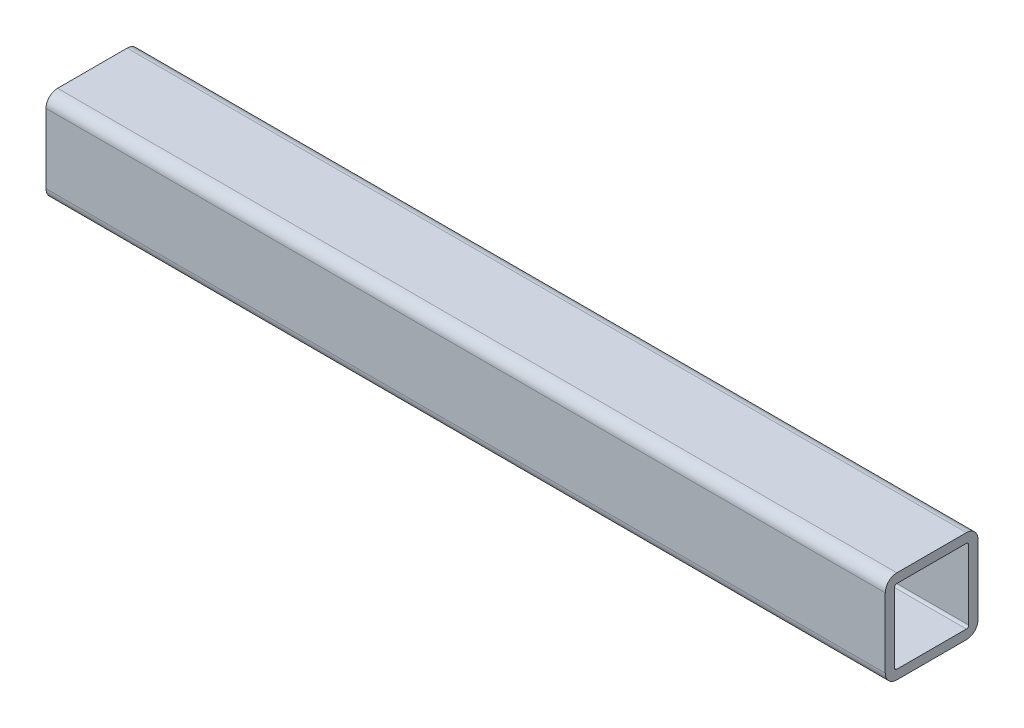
ISO-10303-21;
HEADER;
FILE_DESCRIPTION(('STEP AP214'),'2;1');
FILE_NAME('part.step','',(''),(''),'','','');
FILE_SCHEMA(('AUTOMOTIVE_DESIGN { 1 0 10303 214 1 1 1 1 }'));
ENDSEC;
DATA;
#1=APPLICATION_CONTEXT('core data for automotive mechanical design processes');
#2=APPLICATION_PROTOCOL_DEFINITION('international standard','automotive_design',2000,#1);
#3=PRODUCT_CONTEXT('',#1,'mechanical');
#4=PRODUCT('Part','Part','',(#3));
#5=PRODUCT_RELATED_PRODUCT_CATEGORY('part','',(#4));
#6=PRODUCT_DEFINITION_FORMATION('','',#4);
#7=PRODUCT_DEFINITION_CONTEXT('part definition',#1,'design');
#8=PRODUCT_DEFINITION('design','',#6,#7);
#9=PRODUCT_DEFINITION_SHAPE('','',#8);
#10=(LENGTH_UNIT() NAMED_UNIT(*) SI_UNIT(.MILLI.,.METRE.));
#11=(NAMED_UNIT(*) PLANE_ANGLE_UNIT() SI_UNIT($,.RADIAN.));
#12=(NAMED_UNIT(*) SI_UNIT($,.STERADIAN.) SOLID_ANGLE_UNIT());
#13=UNCERTAINTY_MEASURE_WITH_UNIT(LENGTH_MEASURE(1.E-05),#10,'distance_accuracy_value','');
#14=(GEOMETRIC_REPRESENTATION_CONTEXT(3) GLOBAL_UNCERTAINTY_ASSIGNED_CONTEXT((#13)) GLOBAL_UNIT_ASSIGNED_CONTEXT((#10,
#11,#12)) REPRESENTATION_CONTEXT('',''));
#15=CARTESIAN_POINT('',(0.,0.,0.));
#16=DIRECTION('',(0.,0.,1.));
#17=DIRECTION('',(1.,0.,0.));
#18=AXIS2_PLACEMENT_3D('',#15,#16,#17);
#19=CARTESIAN_POINT('',(180.969736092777,-7.5,7.5));
#20=DIRECTION('',(-1.,0.,0.));
#21=DIRECTION('',(0.,0.,1.));
#22=AXIS2_PLACEMENT_3D('',#19,#20,#21);
#23=CYLINDRICAL_SURFACE('',#22,2.5);
#24=CARTESIAN_POINT('',(0.,-7.5,7.5));
#25=DIRECTION('',(1.,0.,0.));
#26=DIRECTION('',(0.,0.,-1.));
#27=AXIS2_PLACEMENT_3D('',#24,#25,#26);
#28=CIRCLE('',#27,2.5);
#29=CARTESIAN_POINT('',(0.,-7.5,10.));
#30=VERTEX_POINT('',#29);
#31=CARTESIAN_POINT('',(0.,-10.,7.5));
#32=VERTEX_POINT('',#31);
#33=EDGE_CURVE('E208',#30,#32,#28,.T.);
#34=ORIENTED_EDGE('',*,*,#33,.T.);
#35=DIRECTION('',(-1.,0.,0.));
#36=VECTOR('',#35,1.);
#37=CARTESIAN_POINT('',(180.969736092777,-10.,7.5));
#38=LINE('',#37,#36);
#39=CARTESIAN_POINT('',(180.969736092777,-10.,7.5));
#40=VERTEX_POINT('',#39);
#41=EDGE_CURVE('E11',#40,#32,#38,.T.);
#42=ORIENTED_EDGE('',*,*,#41,.F.);
#43=CARTESIAN_POINT('',(180.969736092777,-7.5,7.5));
#44=DIRECTION('',(1.,0.,0.));
#45=DIRECTION('',(0.,0.,-1.));
#46=AXIS2_PLACEMENT_3D('',#43,#44,#45);
#47=CIRCLE('',#46,2.5);
#48=CARTESIAN_POINT('',(180.969736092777,-7.5,10.));
#49=VERTEX_POINT('',#48);
#50=EDGE_CURVE('E286',#49,#40,#47,.T.);
#51=ORIENTED_EDGE('',*,*,#50,.F.);
#52=DIRECTION('',(-1.,0.,0.));
#53=VECTOR('',#52,1.);
#54=CARTESIAN_POINT('',(180.969736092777,-7.5,10.));
#55=LINE('',#54,#53);
#56=EDGE_CURVE('E223',#49,#30,#55,.T.);
#57=ORIENTED_EDGE('',*,*,#56,.T.);
#58=EDGE_LOOP('',(#34,#42,#51,#57));
#59=FACE_BOUND('',#58,.T.);
#60=ADVANCED_FACE('F36',(#59),#23,.T.);
#61=CARTESIAN_POINT('',(180.969736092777,-10.,7.5));
#62=DIRECTION('',(0.,1.,0.));
#63=DIRECTION('',(0.,0.,1.));
#64=AXIS2_PLACEMENT_3D('',#61,#62,#63);
#65=PLANE('',#64);
#66=DIRECTION('',(0.,0.,-1.));
#67=VECTOR('',#66,1.);
#68=CARTESIAN_POINT('',(0.,-10.,7.5));
#69=LINE('',#68,#67);
#70=CARTESIAN_POINT('',(0.,-10.,-7.5));
#71=VERTEX_POINT('',#70);
#72=EDGE_CURVE('E211',#32,#71,#69,.T.);
#73=ORIENTED_EDGE('',*,*,#72,.T.);
#74=DIRECTION('',(-1.,0.,0.));
#75=VECTOR('',#74,1.);
#76=CARTESIAN_POINT('',(180.969736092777,-10.,-7.5));
#77=LINE('',#76,#75);
#78=CARTESIAN_POINT('',(180.969736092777,-10.,-7.5));
#79=VERTEX_POINT('',#78);
#80=EDGE_CURVE('E46',#79,#71,#77,.T.);
#81=ORIENTED_EDGE('',*,*,#80,.F.);
#82=DIRECTION('',(0.,0.,-1.));
#83=VECTOR('',#82,1.);
#84=CARTESIAN_POINT('',(180.969736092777,-10.,7.5));
#85=LINE('',#84,#83);
#86=EDGE_CURVE('E288',#40,#79,#85,.T.);
#87=ORIENTED_EDGE('',*,*,#86,.F.);
#88=ORIENTED_EDGE('',*,*,#41,.T.);
#89=EDGE_LOOP('',(#73,#81,#87,#88));
#90=FACE_BOUND('',#89,.T.);
#91=ADVANCED_FACE('F323',(#90),#65,.F.);
#92=CARTESIAN_POINT('',(180.969736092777,-7.5,-7.5));
#93=DIRECTION('',(-1.,0.,0.));
#94=DIRECTION('',(0.,0.,1.));
#95=AXIS2_PLACEMENT_3D('',#92,#93,#94);
#96=CYLINDRICAL_SURFACE('',#95,2.5);
#97=CARTESIAN_POINT('',(0.,-7.5,-7.5));
#98=DIRECTION('',(1.,0.,0.));
#99=DIRECTION('',(0.,0.,-1.));
#100=AXIS2_PLACEMENT_3D('',#97,#98,#99);
#101=CIRCLE('',#100,2.5);
#102=CARTESIAN_POINT('',(0.,-7.5,-10.));
#103=VERTEX_POINT('',#102);
#104=EDGE_CURVE('E213',#71,#103,#101,.T.);
#105=ORIENTED_EDGE('',*,*,#104,.T.);
#106=DIRECTION('',(-1.,0.,0.));
#107=VECTOR('',#106,1.);
#108=CARTESIAN_POINT('',(180.969736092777,-7.5,-10.));
#109=LINE('',#108,#107);
#110=CARTESIAN_POINT('',(180.969736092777,-7.5,-10.));
#111=VERTEX_POINT('',#110);
#112=EDGE_CURVE('E230',#111,#103,#109,.T.);
#113=ORIENTED_EDGE('',*,*,#112,.F.);
#114=CARTESIAN_POINT('',(180.969736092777,-7.5,-7.5));
#115=DIRECTION('',(1.,0.,0.));
#116=DIRECTION('',(0.,0.,-1.));
#117=AXIS2_PLACEMENT_3D('',#114,#115,#116);
#118=CIRCLE('',#117,2.5);
#119=EDGE_CURVE('E290',#79,#111,#118,.T.);
#120=ORIENTED_EDGE('',*,*,#119,.F.);
#121=ORIENTED_EDGE('',*,*,#80,.T.);
#122=EDGE_LOOP('',(#105,#113,#120,#121));
#123=FACE_BOUND('',#122,.T.);
#124=ADVANCED_FACE('F328',(#123),#96,.T.);
#125=CARTESIAN_POINT('',(180.969736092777,7.5,-10.));
#126=DIRECTION('',(0.,0.,1.));
#127=DIRECTION('',(1.,0.,0.));
#128=AXIS2_PLACEMENT_3D('',#125,#126,#127);
#129=PLANE('',#128);
#130=DIRECTION('',(0.,1.,0.));
#131=VECTOR('',#130,1.);
#132=CARTESIAN_POINT('',(0.,7.5,-10.));
#133=LINE('',#132,#131);
#134=CARTESIAN_POINT('',(0.,7.5,-10.));
#135=VERTEX_POINT('',#134);
#136=EDGE_CURVE('E215',#103,#135,#133,.T.);
#137=ORIENTED_EDGE('',*,*,#136,.T.);
#138=DIRECTION('',(-1.,0.,0.));
#139=VECTOR('',#138,1.);
#140=CARTESIAN_POINT('',(180.969736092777,7.5,-10.));
#141=LINE('',#140,#139);
#142=CARTESIAN_POINT('',(180.969736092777,7.5,-10.));
#143=VERTEX_POINT('',#142);
#144=EDGE_CURVE('E227',#143,#135,#141,.T.);
#145=ORIENTED_EDGE('',*,*,#144,.F.);
#146=DIRECTION('',(0.,1.,0.));
#147=VECTOR('',#146,1.);
#148=CARTESIAN_POINT('',(180.969736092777,7.5,-10.));
#149=LINE('',#148,#147);
#150=EDGE_CURVE('E292',#111,#143,#149,.T.);
#151=ORIENTED_EDGE('',*,*,#150,.F.);
#152=ORIENTED_EDGE('',*,*,#112,.T.);
#153=EDGE_LOOP('',(#137,#145,#151,#152));
#154=FACE_BOUND('',#153,.T.);
#155=ADVANCED_FACE('F298',(#154),#129,.F.);
#156=CARTESIAN_POINT('',(180.969736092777,7.5,-7.5));
#157=DIRECTION('',(-1.,0.,0.));
#158=DIRECTION('',(0.,0.,1.));
#159=AXIS2_PLACEMENT_3D('',#156,#157,#158);
#160=CYLINDRICAL_SURFACE('',#159,2.5);
#161=CARTESIAN_POINT('',(0.,7.5,-7.5));
#162=DIRECTION('',(1.,0.,0.));
#163=DIRECTION('',(0.,0.,-1.));
#164=AXIS2_PLACEMENT_3D('',#161,#162,#163);
#165=CIRCLE('',#164,2.5);
#166=CARTESIAN_POINT('',(0.,10.,-7.5));
#167=VERTEX_POINT('',#166);
#168=EDGE_CURVE('E217',#135,#167,#165,.T.);
#169=ORIENTED_EDGE('',*,*,#168,.T.);
#170=DIRECTION('',(-1.,0.,0.));
#171=VECTOR('',#170,1.);
#172=CARTESIAN_POINT('',(180.969736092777,10.,-7.5));
#173=LINE('',#172,#171);
#174=CARTESIAN_POINT('',(180.969736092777,10.,-7.5));
#175=VERTEX_POINT('',#174);
#176=EDGE_CURVE('E175',#175,#167,#173,.T.);
#177=ORIENTED_EDGE('',*,*,#176,.F.);
#178=CARTESIAN_POINT('',(180.969736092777,7.5,-7.5));
#179=DIRECTION('',(1.,0.,0.));
#180=DIRECTION('',(0.,0.,-1.));
#181=AXIS2_PLACEMENT_3D('',#178,#179,#180);
#182=CIRCLE('',#181,2.5);
#183=EDGE_CURVE('E166',#143,#175,#182,.T.);
#184=ORIENTED_EDGE('',*,*,#183,.F.);
#185=ORIENTED_EDGE('',*,*,#144,.T.);
#186=EDGE_LOOP('',(#169,#177,#184,#185));
#187=FACE_BOUND('',#186,.T.);
#188=ADVANCED_FACE('F302',(#187),#160,.T.);
#189=CARTESIAN_POINT('',(180.969736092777,10.,-7.5));
#190=DIRECTION('',(0.,-1.,0.));
#191=DIRECTION('',(0.,0.,-1.));
#192=AXIS2_PLACEMENT_3D('',#189,#190,#191);
#193=PLANE('',#192);
#194=DIRECTION('',(0.,0.,1.));
#195=VECTOR('',#194,1.);
#196=CARTESIAN_POINT('',(0.,10.,-7.5));
#197=LINE('',#196,#195);
#198=CARTESIAN_POINT('',(0.,10.,7.5));
#199=VERTEX_POINT('',#198);
#200=EDGE_CURVE('E174',#167,#199,#197,.T.);
#201=ORIENTED_EDGE('',*,*,#200,.T.);
#202=DIRECTION('',(-1.,0.,0.));
#203=VECTOR('',#202,1.);
#204=CARTESIAN_POINT('',(180.969736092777,10.,7.5));
#205=LINE('',#204,#203);
#206=CARTESIAN_POINT('',(180.969736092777,10.,7.5));
#207=VERTEX_POINT('',#206);
#208=EDGE_CURVE('E171',#207,#199,#205,.T.);
#209=ORIENTED_EDGE('',*,*,#208,.F.);
#210=DIRECTION('',(0.,0.,1.));
#211=VECTOR('',#210,1.);
#212=CARTESIAN_POINT('',(180.969736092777,10.,-7.5));
#213=LINE('',#212,#211);
#214=EDGE_CURVE('E160',#175,#207,#213,.T.);
#215=ORIENTED_EDGE('',*,*,#214,.F.);
#216=ORIENTED_EDGE('',*,*,#176,.T.);
#217=EDGE_LOOP('',(#201,#209,#215,#216));
#218=FACE_BOUND('',#217,.T.);
#219=ADVANCED_FACE('F172',(#218),#193,.F.);
#220=CARTESIAN_POINT('',(180.969736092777,7.5,7.5));
#221=DIRECTION('',(-1.,0.,0.));
#222=DIRECTION('',(0.,0.,1.));
#223=AXIS2_PLACEMENT_3D('',#220,#221,#222);
#224=CYLINDRICAL_SURFACE('',#223,2.5);
#225=CARTESIAN_POINT('',(0.,7.5,7.5));
#226=DIRECTION('',(1.,0.,0.));
#227=DIRECTION('',(0.,0.,-1.));
#228=AXIS2_PLACEMENT_3D('',#225,#226,#227);
#229=CIRCLE('',#228,2.5);
#230=CARTESIAN_POINT('',(0.,7.5,10.));
#231=VERTEX_POINT('',#230);
#232=EDGE_CURVE('E108',#199,#231,#229,.T.);
#233=ORIENTED_EDGE('',*,*,#232,.T.);
#234=DIRECTION('',(-1.,0.,0.));
#235=VECTOR('',#234,1.);
#236=CARTESIAN_POINT('',(180.969736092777,7.5,10.));
#237=LINE('',#236,#235);
#238=CARTESIAN_POINT('',(180.969736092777,7.5,10.));
#239=VERTEX_POINT('',#238);
#240=EDGE_CURVE('E176',#239,#231,#237,.T.);
#241=ORIENTED_EDGE('',*,*,#240,.F.);
#242=CARTESIAN_POINT('',(180.969736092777,7.5,7.5));
#243=DIRECTION('',(1.,0.,0.));
#244=DIRECTION('',(0.,0.,-1.));
#245=AXIS2_PLACEMENT_3D('',#242,#243,#244);
#246=CIRCLE('',#245,2.5);
#247=EDGE_CURVE('E164',#207,#239,#246,.T.);
#248=ORIENTED_EDGE('',*,*,#247,.F.);
#249=ORIENTED_EDGE('',*,*,#208,.T.);
#250=EDGE_LOOP('',(#233,#241,#248,#249));
#251=FACE_BOUND('',#250,.T.);
#252=ADVANCED_FACE('F178',(#251),#224,.T.);
#253=CARTESIAN_POINT('',(180.969736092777,-7.5,-7.5));
#254=DIRECTION('',(-1.,0.,0.));
#255=DIRECTION('',(0.,0.,1.));
#256=AXIS2_PLACEMENT_3D('',#253,#254,#255);
#257=CYLINDRICAL_SURFACE('',#256,0.5);
#258=CARTESIAN_POINT('',(0.,-7.5,-7.5));
#259=DIRECTION('',(1.,0.,0.));
#260=DIRECTION('',(0.,0.,-1.));
#261=AXIS2_PLACEMENT_3D('',#258,#259,#260);
#262=CIRCLE('',#261,0.5);
#263=CARTESIAN_POINT('',(0.,-8.,-7.5));
#264=VERTEX_POINT('',#263);
#265=CARTESIAN_POINT('',(0.,-7.5,-8.));
#266=VERTEX_POINT('',#265);
#267=EDGE_CURVE('E184',#264,#266,#262,.T.);
#268=ORIENTED_EDGE('',*,*,#267,.F.);
#269=DIRECTION('',(-1.,0.,0.));
#270=VECTOR('',#269,1.);
#271=CARTESIAN_POINT('',(180.969736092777,-8.,-7.5));
#272=LINE('',#271,#270);
#273=CARTESIAN_POINT('',(180.969736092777,-8.,-7.5));
#274=VERTEX_POINT('',#273);
#275=EDGE_CURVE('E40',#274,#264,#272,.T.);
#276=ORIENTED_EDGE('',*,*,#275,.F.);
#277=CARTESIAN_POINT('',(180.969736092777,-7.5,-7.5));
#278=DIRECTION('',(1.,0.,0.));
#279=DIRECTION('',(0.,0.,-1.));
#280=AXIS2_PLACEMENT_3D('',#277,#278,#279);
#281=CIRCLE('',#280,0.5);
#282=CARTESIAN_POINT('',(180.969736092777,-7.5,-8.));
#283=VERTEX_POINT('',#282);
#284=EDGE_CURVE('E222',#274,#283,#281,.T.);
#285=ORIENTED_EDGE('',*,*,#284,.T.);
#286=DIRECTION('',(-1.,0.,0.));
#287=VECTOR('',#286,1.);
#288=CARTESIAN_POINT('',(180.969736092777,-7.5,-8.));
#289=LINE('',#288,#287);
#290=EDGE_CURVE('E180',#283,#266,#289,.T.);
#291=ORIENTED_EDGE('',*,*,#290,.T.);
#292=EDGE_LOOP('',(#268,#276,#285,#291));
#293=FACE_BOUND('',#292,.T.);
#294=ADVANCED_FACE('F38',(#293),#257,.F.);
#295=CARTESIAN_POINT('',(180.969736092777,-8.,7.5));
#296=DIRECTION('',(0.,1.,0.));
#297=DIRECTION('',(0.,0.,1.));
#298=AXIS2_PLACEMENT_3D('',#295,#296,#297);
#299=PLANE('',#298);
#300=DIRECTION('',(0.,0.,-1.));
#301=VECTOR('',#300,1.);
#302=CARTESIAN_POINT('',(0.,-8.,7.5));
#303=LINE('',#302,#301);
#304=CARTESIAN_POINT('',(0.,-8.,7.5));
#305=VERTEX_POINT('',#304);
#306=EDGE_CURVE('E187',#305,#264,#303,.T.);
#307=ORIENTED_EDGE('',*,*,#306,.F.);
#308=DIRECTION('',(-1.,0.,0.));
#309=VECTOR('',#308,1.);
#310=CARTESIAN_POINT('',(180.969736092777,-8.,7.5));
#311=LINE('',#310,#309);
#312=CARTESIAN_POINT('',(180.969736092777,-8.,7.5));
#313=VERTEX_POINT('',#312);
#314=EDGE_CURVE('E245',#313,#305,#311,.T.);
#315=ORIENTED_EDGE('',*,*,#314,.F.);
#316=DIRECTION('',(0.,0.,-1.));
#317=VECTOR('',#316,1.);
#318=CARTESIAN_POINT('',(180.969736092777,-8.,7.5));
#319=LINE('',#318,#317);
#320=EDGE_CURVE('E254',#313,#274,#319,.T.);
#321=ORIENTED_EDGE('',*,*,#320,.T.);
#322=ORIENTED_EDGE('',*,*,#275,.T.);
#323=EDGE_LOOP('',(#307,#315,#321,#322));
#324=FACE_BOUND('',#323,.T.);
#325=ADVANCED_FACE('F252',(#324),#299,.T.);
#326=CARTESIAN_POINT('',(180.969736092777,-7.5,7.5));
#327=DIRECTION('',(-1.,0.,0.));
#328=DIRECTION('',(0.,0.,1.));
#329=AXIS2_PLACEMENT_3D('',#326,#327,#328);
#330=CYLINDRICAL_SURFACE('',#329,0.5);
#331=CARTESIAN_POINT('',(0.,-7.5,7.5));
#332=DIRECTION('',(1.,0.,0.));
#333=DIRECTION('',(0.,0.,-1.));
#334=AXIS2_PLACEMENT_3D('',#331,#332,#333);
#335=CIRCLE('',#334,0.5);
#336=CARTESIAN_POINT('',(0.,-7.5,8.));
#337=VERTEX_POINT('',#336);
#338=EDGE_CURVE('E190',#337,#305,#335,.T.);
#339=ORIENTED_EDGE('',*,*,#338,.F.);
#340=DIRECTION('',(-1.,0.,0.));
#341=VECTOR('',#340,1.);
#342=CARTESIAN_POINT('',(180.969736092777,-7.5,8.));
#343=LINE('',#342,#341);
#344=CARTESIAN_POINT('',(180.969736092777,-7.5,8.));
#345=VERTEX_POINT('',#344);
#346=EDGE_CURVE('E244',#345,#337,#343,.T.);
#347=ORIENTED_EDGE('',*,*,#346,.F.);
#348=CARTESIAN_POINT('',(180.969736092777,-7.5,7.5));
#349=DIRECTION('',(1.,0.,0.));
#350=DIRECTION('',(0.,0.,-1.));
#351=AXIS2_PLACEMENT_3D('',#348,#349,#350);
#352=CIRCLE('',#351,0.5);
#353=EDGE_CURVE('E262',#345,#313,#352,.T.);
#354=ORIENTED_EDGE('',*,*,#353,.T.);
#355=ORIENTED_EDGE('',*,*,#314,.T.);
#356=EDGE_LOOP('',(#339,#347,#354,#355));
#357=FACE_BOUND('',#356,.T.);
#358=ADVANCED_FACE('F260',(#357),#330,.F.);
#359=CARTESIAN_POINT('',(180.969736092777,-7.5,8.));
#360=DIRECTION('',(0.,0.,-1.));
#361=DIRECTION('',(-1.,0.,0.));
#362=AXIS2_PLACEMENT_3D('',#359,#360,#361);
#363=PLANE('',#362);
#364=DIRECTION('',(0.,-1.,0.));
#365=VECTOR('',#364,1.);
#366=CARTESIAN_POINT('',(0.,-7.5,8.));
#367=LINE('',#366,#365);
#368=CARTESIAN_POINT('',(0.,7.5,8.));
#369=VERTEX_POINT('',#368);
#370=EDGE_CURVE('E193',#369,#337,#367,.T.);
#371=ORIENTED_EDGE('',*,*,#370,.F.);
#372=DIRECTION('',(-1.,0.,0.));
#373=VECTOR('',#372,1.);
#374=CARTESIAN_POINT('',(180.969736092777,7.5,8.));
#375=LINE('',#374,#373);
#376=CARTESIAN_POINT('',(180.969736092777,7.5,8.));
#377=VERTEX_POINT('',#376);
#378=EDGE_CURVE('E242',#377,#369,#375,.T.);
#379=ORIENTED_EDGE('',*,*,#378,.F.);
#380=DIRECTION('',(0.,-1.,0.));
#381=VECTOR('',#380,1.);
#382=CARTESIAN_POINT('',(180.969736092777,-7.5,8.));
#383=LINE('',#382,#381);
#384=EDGE_CURVE('E268',#377,#345,#383,.T.);
#385=ORIENTED_EDGE('',*,*,#384,.T.);
#386=ORIENTED_EDGE('',*,*,#346,.T.);
#387=EDGE_LOOP('',(#371,#379,#385,#386));
#388=FACE_BOUND('',#387,.T.);
#389=ADVANCED_FACE('F271',(#388),#363,.T.);
#390=CARTESIAN_POINT('',(180.969736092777,7.5,7.5));
#391=DIRECTION('',(-1.,0.,0.));
#392=DIRECTION('',(0.,0.,1.));
#393=AXIS2_PLACEMENT_3D('',#390,#391,#392);
#394=CYLINDRICAL_SURFACE('',#393,0.5);
#395=CARTESIAN_POINT('',(0.,7.5,7.5));
#396=DIRECTION('',(1.,0.,0.));
#397=DIRECTION('',(0.,0.,-1.));
#398=AXIS2_PLACEMENT_3D('',#395,#396,#397);
#399=CIRCLE('',#398,0.5);
#400=CARTESIAN_POINT('',(0.,8.,7.5));
#401=VERTEX_POINT('',#400);
#402=EDGE_CURVE('E196',#401,#369,#399,.T.);
#403=ORIENTED_EDGE('',*,*,#402,.F.);
#404=DIRECTION('',(-1.,0.,0.));
#405=VECTOR('',#404,1.);
#406=CARTESIAN_POINT('',(180.969736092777,8.,7.5));
#407=LINE('',#406,#405);
#408=CARTESIAN_POINT('',(180.969736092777,8.,7.5));
#409=VERTEX_POINT('',#408);
#410=EDGE_CURVE('E240',#409,#401,#407,.T.);
#411=ORIENTED_EDGE('',*,*,#410,.F.);
#412=CARTESIAN_POINT('',(180.969736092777,7.5,7.5));
#413=DIRECTION('',(1.,0.,0.));
#414=DIRECTION('',(0.,0.,-1.));
#415=AXIS2_PLACEMENT_3D('',#412,#413,#414);
#416=CIRCLE('',#415,0.5);
#417=EDGE_CURVE('E272',#409,#377,#416,.T.);
#418=ORIENTED_EDGE('',*,*,#417,.T.);
#419=ORIENTED_EDGE('',*,*,#378,.T.);
#420=EDGE_LOOP('',(#403,#411,#418,#419));
#421=FACE_BOUND('',#420,.T.);
#422=ADVANCED_FACE('F339',(#421),#394,.F.);
#423=CARTESIAN_POINT('',(180.969736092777,8.,-7.5));
#424=DIRECTION('',(0.,-1.,0.));
#425=DIRECTION('',(0.,0.,-1.));
#426=AXIS2_PLACEMENT_3D('',#423,#424,#425);
#427=PLANE('',#426);
#428=DIRECTION('',(0.,0.,1.));
#429=VECTOR('',#428,1.);
#430=CARTESIAN_POINT('',(0.,8.,-7.5));
#431=LINE('',#430,#429);
#432=CARTESIAN_POINT('',(0.,8.,-7.5));
#433=VERTEX_POINT('',#432);
#434=EDGE_CURVE('E199',#433,#401,#431,.T.);
#435=ORIENTED_EDGE('',*,*,#434,.F.);
#436=DIRECTION('',(-1.,0.,0.));
#437=VECTOR('',#436,1.);
#438=CARTESIAN_POINT('',(180.969736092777,8.,-7.5));
#439=LINE('',#438,#437);
#440=CARTESIAN_POINT('',(180.969736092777,8.,-7.5));
#441=VERTEX_POINT('',#440);
#442=EDGE_CURVE('E238',#441,#433,#439,.T.);
#443=ORIENTED_EDGE('',*,*,#442,.F.);
#444=DIRECTION('',(0.,0.,1.));
#445=VECTOR('',#444,1.);
#446=CARTESIAN_POINT('',(180.969736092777,8.,-7.5));
#447=LINE('',#446,#445);
#448=EDGE_CURVE('E274',#441,#409,#447,.T.);
#449=ORIENTED_EDGE('',*,*,#448,.T.);
#450=ORIENTED_EDGE('',*,*,#410,.T.);
#451=EDGE_LOOP('',(#435,#443,#449,#450));
#452=FACE_BOUND('',#451,.T.);
#453=ADVANCED_FACE('F335',(#452),#427,.T.);
#454=CARTESIAN_POINT('',(180.969736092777,7.5,-7.5));
#455=DIRECTION('',(-1.,0.,0.));
#456=DIRECTION('',(0.,0.,1.));
#457=AXIS2_PLACEMENT_3D('',#454,#455,#456);
#458=CYLINDRICAL_SURFACE('',#457,0.5);
#459=CARTESIAN_POINT('',(0.,7.5,-7.5));
#460=DIRECTION('',(1.,0.,0.));
#461=DIRECTION('',(0.,0.,-1.));
#462=AXIS2_PLACEMENT_3D('',#459,#460,#461);
#463=CIRCLE('',#462,0.5);
#464=CARTESIAN_POINT('',(0.,7.5,-8.));
#465=VERTEX_POINT('',#464);
#466=EDGE_CURVE('E202',#465,#433,#463,.T.);
#467=ORIENTED_EDGE('',*,*,#466,.F.);
#468=DIRECTION('',(-1.,0.,0.));
#469=VECTOR('',#468,1.);
#470=CARTESIAN_POINT('',(180.969736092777,7.5,-8.));
#471=LINE('',#470,#469);
#472=CARTESIAN_POINT('',(180.969736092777,7.5,-8.));
#473=VERTEX_POINT('',#472);
#474=EDGE_CURVE('E236',#473,#465,#471,.T.);
#475=ORIENTED_EDGE('',*,*,#474,.F.);
#476=CARTESIAN_POINT('',(180.969736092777,7.5,-7.5));
#477=DIRECTION('',(1.,0.,0.));
#478=DIRECTION('',(0.,0.,-1.));
#479=AXIS2_PLACEMENT_3D('',#476,#477,#478);
#480=CIRCLE('',#479,0.5);
#481=EDGE_CURVE('E280',#473,#441,#480,.T.);
#482=ORIENTED_EDGE('',*,*,#481,.T.);
#483=ORIENTED_EDGE('',*,*,#442,.T.);
#484=EDGE_LOOP('',(#467,#475,#482,#483));
#485=FACE_BOUND('',#484,.T.);
#486=ADVANCED_FACE('F317',(#485),#458,.F.);
#487=CARTESIAN_POINT('',(180.969736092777,7.5,-8.));
#488=DIRECTION('',(0.,0.,1.));
#489=DIRECTION('',(1.,0.,0.));
#490=AXIS2_PLACEMENT_3D('',#487,#488,#489);
#491=PLANE('',#490);
#492=DIRECTION('',(0.,1.,0.));
#493=VECTOR('',#492,1.);
#494=CARTESIAN_POINT('',(0.,7.5,-8.));
#495=LINE('',#494,#493);
#496=EDGE_CURVE('E205',#266,#465,#495,.T.);
#497=ORIENTED_EDGE('',*,*,#496,.F.);
#498=ORIENTED_EDGE('',*,*,#290,.F.);
#499=DIRECTION('',(0.,1.,0.));
#500=VECTOR('',#499,1.);
#501=CARTESIAN_POINT('',(180.969736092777,7.5,-8.));
#502=LINE('',#501,#500);
#503=EDGE_CURVE('E283',#283,#473,#502,.T.);
#504=ORIENTED_EDGE('',*,*,#503,.T.);
#505=ORIENTED_EDGE('',*,*,#474,.T.);
#506=EDGE_LOOP('',(#497,#498,#504,#505));
#507=FACE_BOUND('',#506,.T.);
#508=ADVANCED_FACE('F310',(#507),#491,.T.);
#509=CARTESIAN_POINT('',(180.969736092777,-7.5,10.));
#510=DIRECTION('',(0.,0.,-1.));
#511=DIRECTION('',(-1.,0.,0.));
#512=AXIS2_PLACEMENT_3D('',#509,#510,#511);
#513=PLANE('',#512);
#514=DIRECTION('',(0.,-1.,0.));
#515=VECTOR('',#514,1.);
#516=CARTESIAN_POINT('',(0.,-7.5,10.));
#517=LINE('',#516,#515);
#518=EDGE_CURVE('E114',#231,#30,#517,.T.);
#519=ORIENTED_EDGE('',*,*,#518,.T.);
#520=ORIENTED_EDGE('',*,*,#56,.F.);
#521=DIRECTION('',(0.,-1.,0.));
#522=VECTOR('',#521,1.);
#523=CARTESIAN_POINT('',(180.969736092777,-7.5,10.));
#524=LINE('',#523,#522);
#525=EDGE_CURVE('E55',#239,#49,#524,.T.);
#526=ORIENTED_EDGE('',*,*,#525,.F.);
#527=ORIENTED_EDGE('',*,*,#240,.T.);
#528=EDGE_LOOP('',(#519,#520,#526,#527));
#529=FACE_BOUND('',#528,.T.);
#530=ADVANCED_FACE('F308',(#529),#513,.F.);
#531=CARTESIAN_POINT('',(180.969736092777,-7.5,7.5));
#532=DIRECTION('',(1.,0.,0.));
#533=DIRECTION('',(0.,0.,-1.));
#534=AXIS2_PLACEMENT_3D('',#531,#532,#533);
#535=PLANE('',#534);
#536=ORIENTED_EDGE('',*,*,#284,.F.);
#537=ORIENTED_EDGE('',*,*,#320,.F.);
#538=ORIENTED_EDGE('',*,*,#353,.F.);
#539=ORIENTED_EDGE('',*,*,#384,.F.);
#540=ORIENTED_EDGE('',*,*,#417,.F.);
#541=ORIENTED_EDGE('',*,*,#448,.F.);
#542=ORIENTED_EDGE('',*,*,#481,.F.);
#543=ORIENTED_EDGE('',*,*,#503,.F.);
#544=EDGE_LOOP('',(#536,#537,#538,#539,#540,#541,#542,#543));
#545=FACE_BOUND('',#544,.T.);
#546=ORIENTED_EDGE('',*,*,#50,.T.);
#547=ORIENTED_EDGE('',*,*,#86,.T.);
#548=ORIENTED_EDGE('',*,*,#119,.T.);
#549=ORIENTED_EDGE('',*,*,#150,.T.);
#550=ORIENTED_EDGE('',*,*,#183,.T.);
#551=ORIENTED_EDGE('',*,*,#214,.T.);
#552=ORIENTED_EDGE('',*,*,#247,.T.);
#553=ORIENTED_EDGE('',*,*,#525,.T.);
#554=EDGE_LOOP('',(#546,#547,#548,#549,#550,#551,#552,#553));
#555=FACE_BOUND('',#554,.T.);
#556=ADVANCED_FACE('F162',(#545,#555),#535,.T.);
#557=CARTESIAN_POINT('',(0.,-7.5,7.5));
#558=DIRECTION('',(1.,0.,0.));
#559=DIRECTION('',(0.,0.,-1.));
#560=AXIS2_PLACEMENT_3D('',#557,#558,#559);
#561=PLANE('',#560);
#562=ORIENTED_EDGE('',*,*,#267,.T.);
#563=ORIENTED_EDGE('',*,*,#496,.T.);
#564=ORIENTED_EDGE('',*,*,#466,.T.);
#565=ORIENTED_EDGE('',*,*,#434,.T.);
#566=ORIENTED_EDGE('',*,*,#402,.T.);
#567=ORIENTED_EDGE('',*,*,#370,.T.);
#568=ORIENTED_EDGE('',*,*,#338,.T.);
#569=ORIENTED_EDGE('',*,*,#306,.T.);
#570=EDGE_LOOP('',(#562,#563,#564,#565,#566,#567,#568,#569));
#571=FACE_BOUND('',#570,.T.);
#572=ORIENTED_EDGE('',*,*,#33,.F.);
#573=ORIENTED_EDGE('',*,*,#518,.F.);
#574=ORIENTED_EDGE('',*,*,#232,.F.);
#575=ORIENTED_EDGE('',*,*,#200,.F.);
#576=ORIENTED_EDGE('',*,*,#168,.F.);
#577=ORIENTED_EDGE('',*,*,#136,.F.);
#578=ORIENTED_EDGE('',*,*,#104,.F.);
#579=ORIENTED_EDGE('',*,*,#72,.F.);
#580=EDGE_LOOP('',(#572,#573,#574,#575,#576,#577,#578,#579));
#581=FACE_BOUND('',#580,.T.);
#582=ADVANCED_FACE('F257',(#571,#581),#561,.F.);
#583=CLOSED_SHELL('',(#60,#91,#124,#155,#188,#219,#252,#294,#325,#358,#389,#422,#453,#486,#508,
#530,#556,#582));
#584=MANIFOLD_SOLID_BREP('B2',#583);
#585=ADVANCED_BREP_SHAPE_REPRESENTATION('',(#18,#584),#14);
#586=SHAPE_DEFINITION_REPRESENTATION(#9,#585);
ENDSEC;
END-ISO-10303-21;
